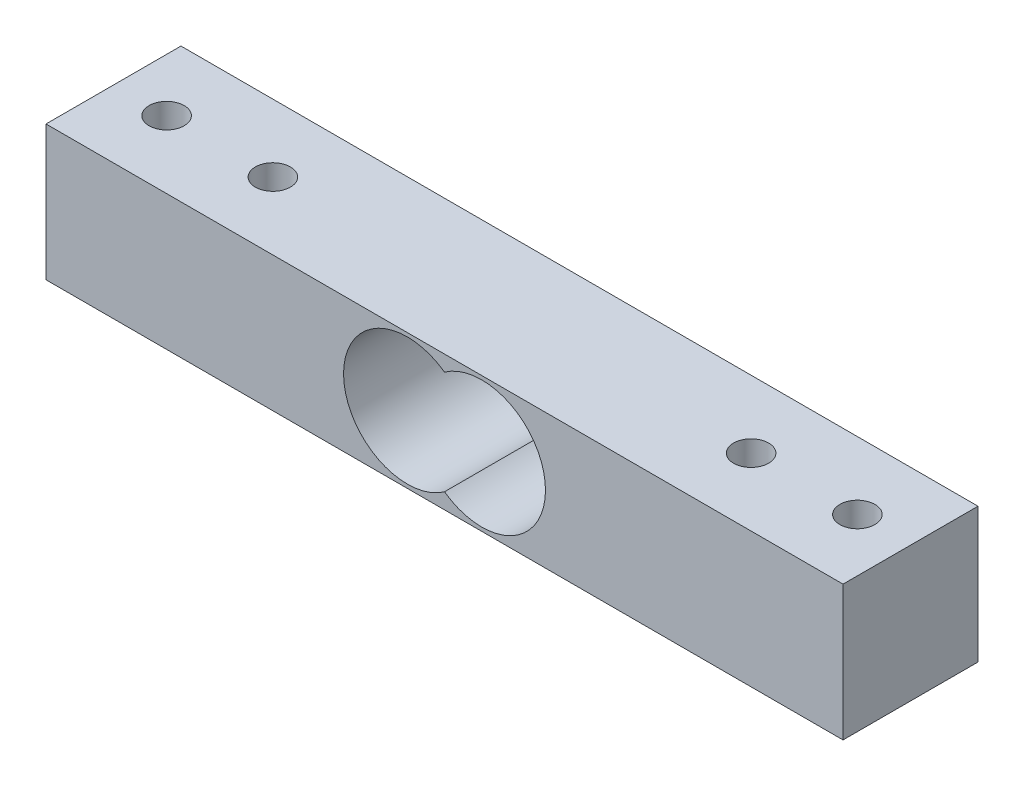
ISO-10303-21;
HEADER;
FILE_DESCRIPTION(('STEP AP214'),'2;1');
FILE_NAME('part.step','',(''),(''),'','','');
FILE_SCHEMA(('AUTOMOTIVE_DESIGN { 1 0 10303 214 1 1 1 1 }'));
ENDSEC;
DATA;
#1=APPLICATION_CONTEXT('core data for automotive mechanical design processes');
#2=APPLICATION_PROTOCOL_DEFINITION('international standard','automotive_design',2000,#1);
#3=PRODUCT_CONTEXT('',#1,'mechanical');
#4=PRODUCT('Part','Part','',(#3));
#5=PRODUCT_RELATED_PRODUCT_CATEGORY('part','',(#4));
#6=PRODUCT_DEFINITION_FORMATION('','',#4);
#7=PRODUCT_DEFINITION_CONTEXT('part definition',#1,'design');
#8=PRODUCT_DEFINITION('design','',#6,#7);
#9=PRODUCT_DEFINITION_SHAPE('','',#8);
#10=(LENGTH_UNIT() NAMED_UNIT(*) SI_UNIT(.MILLI.,.METRE.));
#11=(NAMED_UNIT(*) PLANE_ANGLE_UNIT() SI_UNIT($,.RADIAN.));
#12=(NAMED_UNIT(*) SI_UNIT($,.STERADIAN.) SOLID_ANGLE_UNIT());
#13=UNCERTAINTY_MEASURE_WITH_UNIT(LENGTH_MEASURE(1.E-05),#10,'distance_accuracy_value','');
#14=(GEOMETRIC_REPRESENTATION_CONTEXT(3) GLOBAL_UNCERTAINTY_ASSIGNED_CONTEXT((#13)) GLOBAL_UNIT_ASSIGNED_CONTEXT((#10,
#11,#12)) REPRESENTATION_CONTEXT('',''));
#15=CARTESIAN_POINT('',(0.,0.,0.));
#16=DIRECTION('',(0.,0.,1.));
#17=DIRECTION('',(1.,0.,0.));
#18=AXIS2_PLACEMENT_3D('',#15,#16,#17);
#19=CARTESIAN_POINT('',(-37.5,-12.7,-6.35));
#20=DIRECTION('',(0.,0.,1.));
#21=DIRECTION('',(1.,0.,0.));
#22=AXIS2_PLACEMENT_3D('',#19,#20,#21);
#23=PLANE('',#22);
#24=CARTESIAN_POINT('',(3.5,-6.35,-6.35));
#25=DIRECTION('',(0.,0.,-1.));
#26=DIRECTION('',(-1.,0.,0.));
#27=AXIS2_PLACEMENT_3D('',#24,#25,#26);
#28=CIRCLE('',#27,6.);
#29=CARTESIAN_POINT('',(0.,-1.47660282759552,-6.35));
#30=VERTEX_POINT('',#29);
#31=CARTESIAN_POINT('',(0.,-11.2233971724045,-6.35));
#32=VERTEX_POINT('',#31);
#33=EDGE_CURVE('E104',#30,#32,#28,.T.);
#34=ORIENTED_EDGE('',*,*,#33,.F.);
#35=CARTESIAN_POINT('',(-3.5,-6.35,-6.35));
#36=DIRECTION('',(0.,0.,-1.));
#37=DIRECTION('',(-1.,0.,0.));
#38=AXIS2_PLACEMENT_3D('',#35,#36,#37);
#39=CIRCLE('',#38,6.);
#40=EDGE_CURVE('E55',#32,#30,#39,.T.);
#41=ORIENTED_EDGE('',*,*,#40,.F.);
#42=EDGE_LOOP('',(#34,#41));
#43=FACE_BOUND('',#42,.T.);
#44=DIRECTION('',(1.,0.,0.));
#45=VECTOR('',#44,1.);
#46=CARTESIAN_POINT('',(-37.5,0.,-6.35));
#47=LINE('',#46,#45);
#48=CARTESIAN_POINT('',(-37.5,0.,-6.35));
#49=VERTEX_POINT('',#48);
#50=CARTESIAN_POINT('',(37.5,0.,-6.35));
#51=VERTEX_POINT('',#50);
#52=EDGE_CURVE('E112',#49,#51,#47,.T.);
#53=ORIENTED_EDGE('',*,*,#52,.T.);
#54=DIRECTION('',(0.,1.,0.));
#55=VECTOR('',#54,1.);
#56=CARTESIAN_POINT('',(37.5,-12.7,-6.35));
#57=LINE('',#56,#55);
#58=CARTESIAN_POINT('',(37.5,-12.7,-6.35));
#59=VERTEX_POINT('',#58);
#60=EDGE_CURVE('E11',#59,#51,#57,.T.);
#61=ORIENTED_EDGE('',*,*,#60,.F.);
#62=DIRECTION('',(1.,0.,0.));
#63=VECTOR('',#62,1.);
#64=CARTESIAN_POINT('',(-37.5,-12.7,-6.35));
#65=LINE('',#64,#63);
#66=CARTESIAN_POINT('',(-37.5,-12.7,-6.35));
#67=VERTEX_POINT('',#66);
#68=EDGE_CURVE('E114',#67,#59,#65,.T.);
#69=ORIENTED_EDGE('',*,*,#68,.F.);
#70=DIRECTION('',(0.,1.,0.));
#71=VECTOR('',#70,1.);
#72=CARTESIAN_POINT('',(-37.5,-12.7,-6.35));
#73=LINE('',#72,#71);
#74=EDGE_CURVE('E126',#67,#49,#73,.T.);
#75=ORIENTED_EDGE('',*,*,#74,.T.);
#76=EDGE_LOOP('',(#53,#61,#69,#75));
#77=FACE_BOUND('',#76,.T.);
#78=ADVANCED_FACE('F41',(#43,#77),#23,.F.);
#79=CARTESIAN_POINT('',(37.5,-12.7,-6.35));
#80=DIRECTION('',(-1.,0.,0.));
#81=DIRECTION('',(0.,0.,1.));
#82=AXIS2_PLACEMENT_3D('',#79,#80,#81);
#83=PLANE('',#82);
#84=DIRECTION('',(0.,0.,1.));
#85=VECTOR('',#84,1.);
#86=CARTESIAN_POINT('',(37.5,0.,-6.35));
#87=LINE('',#86,#85);
#88=CARTESIAN_POINT('',(37.5,0.,6.35));
#89=VERTEX_POINT('',#88);
#90=EDGE_CURVE('E129',#51,#89,#87,.T.);
#91=ORIENTED_EDGE('',*,*,#90,.T.);
#92=DIRECTION('',(0.,1.,0.));
#93=VECTOR('',#92,1.);
#94=CARTESIAN_POINT('',(37.5,-12.7,6.35));
#95=LINE('',#94,#93);
#96=CARTESIAN_POINT('',(37.5,-12.7,6.35));
#97=VERTEX_POINT('',#96);
#98=EDGE_CURVE('E48',#97,#89,#95,.T.);
#99=ORIENTED_EDGE('',*,*,#98,.F.);
#100=DIRECTION('',(0.,0.,1.));
#101=VECTOR('',#100,1.);
#102=CARTESIAN_POINT('',(37.5,-12.7,-6.35));
#103=LINE('',#102,#101);
#104=EDGE_CURVE('E117',#59,#97,#103,.T.);
#105=ORIENTED_EDGE('',*,*,#104,.F.);
#106=ORIENTED_EDGE('',*,*,#60,.T.);
#107=EDGE_LOOP('',(#91,#99,#105,#106));
#108=FACE_BOUND('',#107,.T.);
#109=ADVANCED_FACE('F143',(#108),#83,.F.);
#110=CARTESIAN_POINT('',(-37.5,-12.7,6.35));
#111=DIRECTION('',(0.,0.,1.));
#112=DIRECTION('',(1.,0.,0.));
#113=AXIS2_PLACEMENT_3D('',#110,#111,#112);
#114=PLANE('',#113);
#115=CARTESIAN_POINT('',(-3.5,-6.35,6.35));
#116=DIRECTION('',(0.,0.,-1.));
#117=DIRECTION('',(-1.,0.,0.));
#118=AXIS2_PLACEMENT_3D('',#115,#116,#117);
#119=CIRCLE('',#118,6.);
#120=CARTESIAN_POINT('',(0.,-11.2233971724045,6.35));
#121=VERTEX_POINT('',#120);
#122=CARTESIAN_POINT('',(0.,-1.47660282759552,6.35));
#123=VERTEX_POINT('',#122);
#124=EDGE_CURVE('E60',#121,#123,#119,.T.);
#125=ORIENTED_EDGE('',*,*,#124,.T.);
#126=CARTESIAN_POINT('',(3.5,-6.35,6.35));
#127=DIRECTION('',(0.,0.,-1.));
#128=DIRECTION('',(-1.,0.,0.));
#129=AXIS2_PLACEMENT_3D('',#126,#127,#128);
#130=CIRCLE('',#129,6.);
#131=EDGE_CURVE('E96',#123,#121,#130,.T.);
#132=ORIENTED_EDGE('',*,*,#131,.T.);
#133=EDGE_LOOP('',(#125,#132));
#134=FACE_BOUND('',#133,.T.);
#135=DIRECTION('',(1.,0.,0.));
#136=VECTOR('',#135,1.);
#137=CARTESIAN_POINT('',(-37.5,0.,6.35));
#138=LINE('',#137,#136);
#139=CARTESIAN_POINT('',(-37.5,0.,6.35));
#140=VERTEX_POINT('',#139);
#141=EDGE_CURVE('E132',#140,#89,#138,.T.);
#142=ORIENTED_EDGE('',*,*,#141,.F.);
#143=DIRECTION('',(0.,1.,0.));
#144=VECTOR('',#143,1.);
#145=CARTESIAN_POINT('',(-37.5,-12.7,6.35));
#146=LINE('',#145,#144);
#147=CARTESIAN_POINT('',(-37.5,-12.7,6.35));
#148=VERTEX_POINT('',#147);
#149=EDGE_CURVE('E138',#148,#140,#146,.T.);
#150=ORIENTED_EDGE('',*,*,#149,.F.);
#151=DIRECTION('',(1.,0.,0.));
#152=VECTOR('',#151,1.);
#153=CARTESIAN_POINT('',(-37.5,-12.7,6.35));
#154=LINE('',#153,#152);
#155=EDGE_CURVE('E120',#148,#97,#154,.T.);
#156=ORIENTED_EDGE('',*,*,#155,.T.);
#157=ORIENTED_EDGE('',*,*,#98,.T.);
#158=EDGE_LOOP('',(#142,#150,#156,#157));
#159=FACE_BOUND('',#158,.T.);
#160=ADVANCED_FACE('F102',(#134,#159),#114,.T.);
#161=CARTESIAN_POINT('',(-37.5,-12.7,-6.35));
#162=DIRECTION('',(-1.,0.,0.));
#163=DIRECTION('',(0.,0.,1.));
#164=AXIS2_PLACEMENT_3D('',#161,#162,#163);
#165=PLANE('',#164);
#166=DIRECTION('',(0.,0.,1.));
#167=VECTOR('',#166,1.);
#168=CARTESIAN_POINT('',(-37.5,0.,-6.35));
#169=LINE('',#168,#167);
#170=EDGE_CURVE('E118',#49,#140,#169,.T.);
#171=ORIENTED_EDGE('',*,*,#170,.F.);
#172=ORIENTED_EDGE('',*,*,#74,.F.);
#173=DIRECTION('',(0.,0.,1.));
#174=VECTOR('',#173,1.);
#175=CARTESIAN_POINT('',(-37.5,-12.7,-6.35));
#176=LINE('',#175,#174);
#177=EDGE_CURVE('E123',#67,#148,#176,.T.);
#178=ORIENTED_EDGE('',*,*,#177,.T.);
#179=ORIENTED_EDGE('',*,*,#149,.T.);
#180=EDGE_LOOP('',(#171,#172,#178,#179));
#181=FACE_BOUND('',#180,.T.);
#182=ADVANCED_FACE('F150',(#181),#165,.T.);
#183=CARTESIAN_POINT('',(0.,-12.7,0.));
#184=DIRECTION('',(0.,-1.,0.));
#185=DIRECTION('',(0.,0.,-1.));
#186=AXIS2_PLACEMENT_3D('',#183,#184,#185);
#187=PLANE('',#186);
#188=CARTESIAN_POINT('',(-32.5,-12.7,0.));
#189=DIRECTION('',(0.,1.,0.));
#190=DIRECTION('',(0.,0.,1.));
#191=AXIS2_PLACEMENT_3D('',#188,#189,#190);
#192=CIRCLE('',#191,1.65);
#193=CARTESIAN_POINT('',(-32.5,-12.7,1.65));
#194=VERTEX_POINT('',#193);
#195=EDGE_CURVE('E198',#194,#194,#192,.T.);
#196=ORIENTED_EDGE('',*,*,#195,.T.);
#197=EDGE_LOOP('',(#196));
#198=FACE_BOUND('',#197,.T.);
#199=CARTESIAN_POINT('',(-22.5,-12.7,0.));
#200=DIRECTION('',(0.,1.,0.));
#201=DIRECTION('',(0.,0.,1.));
#202=AXIS2_PLACEMENT_3D('',#199,#200,#201);
#203=CIRCLE('',#202,1.65);
#204=CARTESIAN_POINT('',(-22.5,-12.7,1.65));
#205=VERTEX_POINT('',#204);
#206=EDGE_CURVE('E208',#205,#205,#203,.T.);
#207=ORIENTED_EDGE('',*,*,#206,.T.);
#208=EDGE_LOOP('',(#207));
#209=FACE_BOUND('',#208,.T.);
#210=CARTESIAN_POINT('',(22.5,-12.7,0.));
#211=DIRECTION('',(0.,1.,0.));
#212=DIRECTION('',(0.,0.,1.));
#213=AXIS2_PLACEMENT_3D('',#210,#211,#212);
#214=CIRCLE('',#213,1.65);
#215=CARTESIAN_POINT('',(22.5,-12.7,1.65));
#216=VERTEX_POINT('',#215);
#217=EDGE_CURVE('E214',#216,#216,#214,.T.);
#218=ORIENTED_EDGE('',*,*,#217,.T.);
#219=EDGE_LOOP('',(#218));
#220=FACE_BOUND('',#219,.T.);
#221=CARTESIAN_POINT('',(32.5,-12.7,0.));
#222=DIRECTION('',(0.,1.,0.));
#223=DIRECTION('',(0.,0.,1.));
#224=AXIS2_PLACEMENT_3D('',#221,#222,#223);
#225=CIRCLE('',#224,1.65);
#226=CARTESIAN_POINT('',(32.5,-12.7,1.65));
#227=VERTEX_POINT('',#226);
#228=EDGE_CURVE('E108',#227,#227,#225,.T.);
#229=ORIENTED_EDGE('',*,*,#228,.T.);
#230=EDGE_LOOP('',(#229));
#231=FACE_BOUND('',#230,.T.);
#232=ORIENTED_EDGE('',*,*,#68,.T.);
#233=ORIENTED_EDGE('',*,*,#104,.T.);
#234=ORIENTED_EDGE('',*,*,#155,.F.);
#235=ORIENTED_EDGE('',*,*,#177,.F.);
#236=EDGE_LOOP('',(#232,#233,#234,#235));
#237=FACE_BOUND('',#236,.T.);
#238=ADVANCED_FACE('F154',(#198,#209,#220,#231,#237),#187,.T.);
#239=CARTESIAN_POINT('',(0.,0.,0.));
#240=DIRECTION('',(0.,-1.,0.));
#241=DIRECTION('',(0.,0.,-1.));
#242=AXIS2_PLACEMENT_3D('',#239,#240,#241);
#243=PLANE('',#242);
#244=CARTESIAN_POINT('',(-32.5,0.,0.));
#245=DIRECTION('',(0.,1.,0.));
#246=DIRECTION('',(0.,0.,1.));
#247=AXIS2_PLACEMENT_3D('',#244,#245,#246);
#248=CIRCLE('',#247,1.65);
#249=CARTESIAN_POINT('',(-32.5,0.,1.65));
#250=VERTEX_POINT('',#249);
#251=EDGE_CURVE('E201',#250,#250,#248,.T.);
#252=ORIENTED_EDGE('',*,*,#251,.F.);
#253=EDGE_LOOP('',(#252));
#254=FACE_BOUND('',#253,.T.);
#255=CARTESIAN_POINT('',(-22.5,0.,0.));
#256=DIRECTION('',(0.,1.,0.));
#257=DIRECTION('',(0.,0.,1.));
#258=AXIS2_PLACEMENT_3D('',#255,#256,#257);
#259=CIRCLE('',#258,1.65);
#260=CARTESIAN_POINT('',(-22.5,0.,1.65));
#261=VERTEX_POINT('',#260);
#262=EDGE_CURVE('E203',#261,#261,#259,.T.);
#263=ORIENTED_EDGE('',*,*,#262,.F.);
#264=EDGE_LOOP('',(#263));
#265=FACE_BOUND('',#264,.T.);
#266=CARTESIAN_POINT('',(22.5,0.,0.));
#267=DIRECTION('',(0.,1.,0.));
#268=DIRECTION('',(0.,0.,1.));
#269=AXIS2_PLACEMENT_3D('',#266,#267,#268);
#270=CIRCLE('',#269,1.65);
#271=CARTESIAN_POINT('',(22.5,0.,1.65));
#272=VERTEX_POINT('',#271);
#273=EDGE_CURVE('E211',#272,#272,#270,.T.);
#274=ORIENTED_EDGE('',*,*,#273,.F.);
#275=EDGE_LOOP('',(#274));
#276=FACE_BOUND('',#275,.T.);
#277=CARTESIAN_POINT('',(32.5,0.,0.));
#278=DIRECTION('',(0.,1.,0.));
#279=DIRECTION('',(0.,0.,1.));
#280=AXIS2_PLACEMENT_3D('',#277,#278,#279);
#281=CIRCLE('',#280,1.65);
#282=CARTESIAN_POINT('',(32.5,0.,1.65));
#283=VERTEX_POINT('',#282);
#284=EDGE_CURVE('E216',#283,#283,#281,.T.);
#285=ORIENTED_EDGE('',*,*,#284,.F.);
#286=EDGE_LOOP('',(#285));
#287=FACE_BOUND('',#286,.T.);
#288=ORIENTED_EDGE('',*,*,#52,.F.);
#289=ORIENTED_EDGE('',*,*,#170,.T.);
#290=ORIENTED_EDGE('',*,*,#141,.T.);
#291=ORIENTED_EDGE('',*,*,#90,.F.);
#292=EDGE_LOOP('',(#288,#289,#290,#291));
#293=FACE_BOUND('',#292,.T.);
#294=ADVANCED_FACE('F147',(#254,#265,#276,#287,#293),#243,.F.);
#295=CARTESIAN_POINT('',(-3.5,-6.35,6.35));
#296=DIRECTION('',(0.,0.,-1.));
#297=DIRECTION('',(-1.,0.,0.));
#298=AXIS2_PLACEMENT_3D('',#295,#296,#297);
#299=CYLINDRICAL_SURFACE('',#298,6.);
#300=ORIENTED_EDGE('',*,*,#40,.T.);
#301=DIRECTION('',(0.,0.,-1.));
#302=VECTOR('',#301,1.);
#303=CARTESIAN_POINT('',(0.,-1.47660282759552,6.35));
#304=LINE('',#303,#302);
#305=EDGE_CURVE('E89',#123,#30,#304,.T.);
#306=ORIENTED_EDGE('',*,*,#305,.F.);
#307=ORIENTED_EDGE('',*,*,#124,.F.);
#308=DIRECTION('',(0.,0.,-1.));
#309=VECTOR('',#308,1.);
#310=CARTESIAN_POINT('',(0.,-11.2233971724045,6.35));
#311=LINE('',#310,#309);
#312=EDGE_CURVE('E95',#121,#32,#311,.T.);
#313=ORIENTED_EDGE('',*,*,#312,.T.);
#314=EDGE_LOOP('',(#300,#306,#307,#313));
#315=FACE_BOUND('',#314,.T.);
#316=ADVANCED_FACE('F91',(#315),#299,.F.);
#317=CARTESIAN_POINT('',(3.5,-6.35,6.35));
#318=DIRECTION('',(0.,0.,-1.));
#319=DIRECTION('',(-1.,0.,0.));
#320=AXIS2_PLACEMENT_3D('',#317,#318,#319);
#321=CYLINDRICAL_SURFACE('',#320,6.);
#322=ORIENTED_EDGE('',*,*,#33,.T.);
#323=ORIENTED_EDGE('',*,*,#312,.F.);
#324=ORIENTED_EDGE('',*,*,#131,.F.);
#325=ORIENTED_EDGE('',*,*,#305,.T.);
#326=EDGE_LOOP('',(#322,#323,#324,#325));
#327=FACE_BOUND('',#326,.T.);
#328=ADVANCED_FACE('F99',(#327),#321,.F.);
#329=CARTESIAN_POINT('',(32.5,0.,0.));
#330=DIRECTION('',(0.,1.,0.));
#331=DIRECTION('',(0.,0.,1.));
#332=AXIS2_PLACEMENT_3D('',#329,#330,#331);
#333=CYLINDRICAL_SURFACE('',#332,1.65);
#334=ORIENTED_EDGE('',*,*,#228,.F.);
#335=EDGE_LOOP('',(#334));
#336=FACE_BOUND('',#335,.T.);
#337=ORIENTED_EDGE('',*,*,#284,.T.);
#338=EDGE_LOOP('',(#337));
#339=FACE_BOUND('',#338,.T.);
#340=ADVANCED_FACE('F178',(#336,#339),#333,.F.);
#341=CARTESIAN_POINT('',(22.5,0.,0.));
#342=DIRECTION('',(0.,1.,0.));
#343=DIRECTION('',(0.,0.,1.));
#344=AXIS2_PLACEMENT_3D('',#341,#342,#343);
#345=CYLINDRICAL_SURFACE('',#344,1.65);
#346=ORIENTED_EDGE('',*,*,#217,.F.);
#347=EDGE_LOOP('',(#346));
#348=FACE_BOUND('',#347,.T.);
#349=ORIENTED_EDGE('',*,*,#273,.T.);
#350=EDGE_LOOP('',(#349));
#351=FACE_BOUND('',#350,.T.);
#352=ADVANCED_FACE('F181',(#348,#351),#345,.F.);
#353=CARTESIAN_POINT('',(-22.5,0.,0.));
#354=DIRECTION('',(0.,1.,0.));
#355=DIRECTION('',(0.,0.,1.));
#356=AXIS2_PLACEMENT_3D('',#353,#354,#355);
#357=CYLINDRICAL_SURFACE('',#356,1.65);
#358=ORIENTED_EDGE('',*,*,#206,.F.);
#359=EDGE_LOOP('',(#358));
#360=FACE_BOUND('',#359,.T.);
#361=ORIENTED_EDGE('',*,*,#262,.T.);
#362=EDGE_LOOP('',(#361));
#363=FACE_BOUND('',#362,.T.);
#364=ADVANCED_FACE('F185',(#360,#363),#357,.F.);
#365=CARTESIAN_POINT('',(-32.5,0.,0.));
#366=DIRECTION('',(0.,1.,0.));
#367=DIRECTION('',(0.,0.,1.));
#368=AXIS2_PLACEMENT_3D('',#365,#366,#367);
#369=CYLINDRICAL_SURFACE('',#368,1.65);
#370=ORIENTED_EDGE('',*,*,#195,.F.);
#371=EDGE_LOOP('',(#370));
#372=FACE_BOUND('',#371,.T.);
#373=ORIENTED_EDGE('',*,*,#251,.T.);
#374=EDGE_LOOP('',(#373));
#375=FACE_BOUND('',#374,.T.);
#376=ADVANCED_FACE('F189',(#372,#375),#369,.F.);
#377=CLOSED_SHELL('',(#78,#109,#160,#182,#238,#294,#316,#328,#340,#352,#364,#376));
#378=MANIFOLD_SOLID_BREP('B2',#377);
#379=ADVANCED_BREP_SHAPE_REPRESENTATION('',(#18,#378),#14);
#380=SHAPE_DEFINITION_REPRESENTATION(#9,#379);
ENDSEC;
END-ISO-10303-21;
